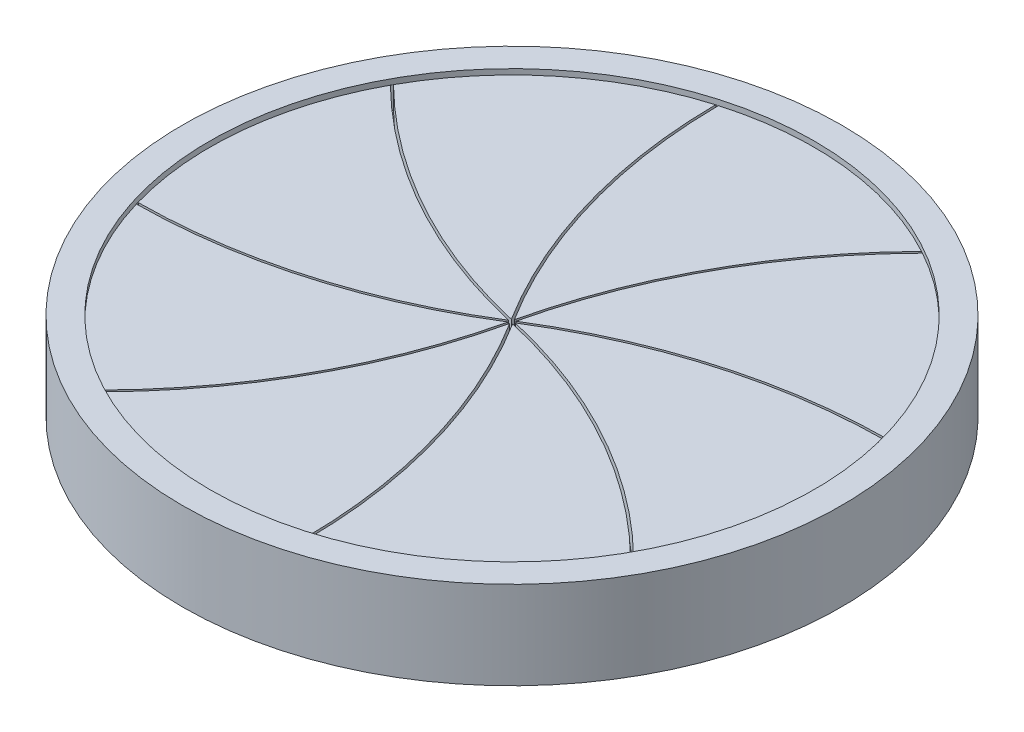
ISO-10303-21;
HEADER;
FILE_DESCRIPTION(('STEP AP214'),'2;1');
FILE_NAME('part.step','',(''),(''),'','','');
FILE_SCHEMA(('AUTOMOTIVE_DESIGN { 1 0 10303 214 1 1 1 1 }'));
ENDSEC;
DATA;
#1=APPLICATION_CONTEXT('core data for automotive mechanical design processes');
#2=APPLICATION_PROTOCOL_DEFINITION('international standard','automotive_design',2000,#1);
#3=PRODUCT_CONTEXT('',#1,'mechanical');
#4=PRODUCT('Part','Part','',(#3));
#5=PRODUCT_RELATED_PRODUCT_CATEGORY('part','',(#4));
#6=PRODUCT_DEFINITION_FORMATION('','',#4);
#7=PRODUCT_DEFINITION_CONTEXT('part definition',#1,'design');
#8=PRODUCT_DEFINITION('design','',#6,#7);
#9=PRODUCT_DEFINITION_SHAPE('','',#8);
#10=(LENGTH_UNIT() NAMED_UNIT(*) SI_UNIT(.MILLI.,.METRE.));
#11=(NAMED_UNIT(*) PLANE_ANGLE_UNIT() SI_UNIT($,.RADIAN.));
#12=(NAMED_UNIT(*) SI_UNIT($,.STERADIAN.) SOLID_ANGLE_UNIT());
#13=UNCERTAINTY_MEASURE_WITH_UNIT(LENGTH_MEASURE(1.E-05),#10,'distance_accuracy_value','');
#14=(GEOMETRIC_REPRESENTATION_CONTEXT(3) GLOBAL_UNCERTAINTY_ASSIGNED_CONTEXT((#13)) GLOBAL_UNIT_ASSIGNED_CONTEXT((#10,
#11,#12)) REPRESENTATION_CONTEXT('',''));
#15=CARTESIAN_POINT('',(0.,0.,0.));
#16=DIRECTION('',(0.,0.,1.));
#17=DIRECTION('',(1.,0.,0.));
#18=AXIS2_PLACEMENT_3D('',#15,#16,#17);
#19=CARTESIAN_POINT('',(0.,7.5,0.));
#20=DIRECTION('',(0.,1.,0.));
#21=DIRECTION('',(0.,0.,1.));
#22=AXIS2_PLACEMENT_3D('',#19,#20,#21);
#23=PLANE('',#22);
#24=CARTESIAN_POINT('',(-42.2702188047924,7.5,26.7063401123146));
#25=DIRECTION('',(0.,1.,0.));
#26=DIRECTION('',(1.,0.,0.));
#27=AXIS2_PLACEMENT_3D('',#24,#25,#26);
#28=CIRCLE('',#27,49.8999999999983);
#29=CARTESIAN_POINT('',(0.0437874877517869,7.5,0.257618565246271));
#30=VERTEX_POINT('',#29);
#31=CARTESIAN_POINT('',(7.62879246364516,7.5,26.3922152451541));
#32=VERTEX_POINT('',#31);
#33=EDGE_CURVE('E1080',#30,#32,#28,.F.);
#34=ORIENTED_EDGE('',*,*,#33,.F.);
#35=CARTESIAN_POINT('',(-48.7737925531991,7.5,-11.0053241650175));
#36=DIRECTION('',(0.,1.,0.));
#37=DIRECTION('',(1.,0.,0.));
#38=AXIS2_PLACEMENT_3D('',#35,#36,#37);
#39=CIRCLE('',#38,50.0999999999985);
#40=CARTESIAN_POINT('',(-13.1052008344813,7.5,24.1765115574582));
#41=VERTEX_POINT('',#40);
#42=EDGE_CURVE('E1095',#30,#41,#39,.F.);
#43=ORIENTED_EDGE('',*,*,#42,.T.);
#44=CARTESIAN_POINT('',(0.,7.5,0.));
#45=DIRECTION('',(0.,1.,0.));
#46=DIRECTION('',(0.,0.,1.));
#47=AXIS2_PLACEMENT_3D('',#44,#45,#46);
#48=CIRCLE('',#47,27.5);
#49=CARTESIAN_POINT('',(7.72879048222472,7.5,26.3915857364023));
#50=VERTEX_POINT('',#49);
#51=EDGE_CURVE('E1122',#41,#50,#48,.T.);
#52=ORIENTED_EDGE('',*,*,#51,.T.);
#53=DIRECTION('',(-0.999980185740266,0.,0.006295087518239));
#54=VECTOR('',#53,1.);
#55=CARTESIAN_POINT('',(7.82878850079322,7.5,26.3909562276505));
#56=LINE('',#55,#54);
#57=EDGE_CURVE('E12',#50,#32,#56,.T.);
#58=ORIENTED_EDGE('',*,*,#57,.T.);
#59=EDGE_LOOP('',(#34,#43,#52,#58));
#60=FACE_BOUND('',#59,.T.);
#61=ADVANCED_FACE('F707',(#60),#23,.T.);
#62=CARTESIAN_POINT('',(-11.0053241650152,7.5,48.7737925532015));
#63=DIRECTION('',(0.,1.,0.));
#64=DIRECTION('',(1.,0.,0.));
#65=AXIS2_PLACEMENT_3D('',#62,#63,#64);
#66=CIRCLE('',#65,49.8999999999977);
#67=CARTESIAN_POINT('',(0.213126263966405,7.5,0.151201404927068));
#68=VERTEX_POINT('',#67);
#69=CARTESIAN_POINT('',(24.0564852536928,7.5,13.2677434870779));
#70=VERTEX_POINT('',#69);
#71=EDGE_CURVE('E1057',#68,#70,#66,.F.);
#72=ORIENTED_EDGE('',*,*,#71,.F.);
#73=CARTESIAN_POINT('',(-42.2702188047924,7.5,26.7063401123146));
#74=DIRECTION('',(0.,1.,0.));
#75=DIRECTION('',(1.,0.,0.));
#76=AXIS2_PLACEMENT_3D('',#73,#74,#75);
#77=CIRCLE('',#76,50.0999999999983);
#78=CARTESIAN_POINT('',(7.82859888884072,7.5,26.3621516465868));
#79=VERTEX_POINT('',#78);
#80=EDGE_CURVE('E1074',#68,#79,#77,.F.);
#81=ORIENTED_EDGE('',*,*,#80,.T.);
#82=CARTESIAN_POINT('',(24.1267494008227,7.5,13.1965890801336));
#83=VERTEX_POINT('',#82);
#84=EDGE_CURVE('E1121',#79,#83,#48,.T.);
#85=ORIENTED_EDGE('',*,*,#84,.T.);
#86=DIRECTION('',(-0.702641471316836,0.,0.711544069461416));
#87=VECTOR('',#86,1.);
#88=CARTESIAN_POINT('',(24.1970135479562,7.5,13.1254346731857));
#89=LINE('',#88,#87);
#90=EDGE_CURVE('E716',#83,#70,#89,.T.);
#91=ORIENTED_EDGE('',*,*,#90,.T.);
#92=EDGE_LOOP('',(#72,#81,#85,#91));
#93=FACE_BOUND('',#92,.T.);
#94=ADVANCED_FACE('F1147',(#93),#23,.T.);
#95=CARTESIAN_POINT('',(26.706340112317,7.5,42.2702188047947));
#96=DIRECTION('',(0.,1.,0.));
#97=DIRECTION('',(1.,0.,0.));
#98=AXIS2_PLACEMENT_3D('',#95,#96,#97);
#99=CIRCLE('',#98,49.8999999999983);
#100=CARTESIAN_POINT('',(0.257618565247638,7.5,-0.0437874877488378));
#101=VERTEX_POINT('',#100);
#102=CARTESIAN_POINT('',(26.3922152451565,7.5,-7.62879246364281));
#103=VERTEX_POINT('',#102);
#104=EDGE_CURVE('E1033',#101,#103,#99,.F.);
#105=ORIENTED_EDGE('',*,*,#104,.F.);
#106=CARTESIAN_POINT('',(-11.0053241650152,7.5,48.7737925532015));
#107=DIRECTION('',(0.,1.,0.));
#108=DIRECTION('',(1.,0.,0.));
#109=AXIS2_PLACEMENT_3D('',#106,#107,#108);
#110=CIRCLE('',#109,50.0999999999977);
#111=CARTESIAN_POINT('',(24.1765115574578,7.5,13.1052008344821));
#112=VERTEX_POINT('',#111);
#113=EDGE_CURVE('E1051',#101,#112,#110,.F.);
#114=ORIENTED_EDGE('',*,*,#113,.T.);
#115=CARTESIAN_POINT('',(26.3915857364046,7.5,-7.72879048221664));
#116=VERTEX_POINT('',#115);
#117=EDGE_CURVE('E1221',#112,#116,#48,.T.);
#118=ORIENTED_EDGE('',*,*,#117,.T.);
#119=DIRECTION('',(0.006295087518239,0.,0.999980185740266));
#120=VECTOR('',#119,1.);
#121=CARTESIAN_POINT('',(26.3909562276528,7.5,-7.82878850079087));
#122=LINE('',#121,#120);
#123=EDGE_CURVE('E1040',#116,#103,#122,.T.);
#124=ORIENTED_EDGE('',*,*,#123,.T.);
#125=EDGE_LOOP('',(#105,#114,#118,#124));
#126=FACE_BOUND('',#125,.T.);
#127=ADVANCED_FACE('F1154',(#126),#23,.T.);
#128=CARTESIAN_POINT('',(48.7737925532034,7.5,11.0053241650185));
#129=DIRECTION('',(0.,1.,0.));
#130=DIRECTION('',(1.,0.,0.));
#131=AXIS2_PLACEMENT_3D('',#128,#129,#130);
#132=CIRCLE('',#131,49.8999999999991);
#133=CARTESIAN_POINT('',(0.151201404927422,7.5,-0.213126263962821));
#134=VERTEX_POINT('',#133);
#135=CARTESIAN_POINT('',(13.2677434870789,7.5,-24.0564852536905));
#136=VERTEX_POINT('',#135);
#137=EDGE_CURVE('E1009',#134,#136,#132,.F.);
#138=ORIENTED_EDGE('',*,*,#137,.F.);
#139=CARTESIAN_POINT('',(26.706340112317,7.5,42.2702188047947));
#140=DIRECTION('',(0.,1.,0.));
#141=DIRECTION('',(1.,0.,0.));
#142=AXIS2_PLACEMENT_3D('',#139,#140,#141);
#143=CIRCLE('',#142,50.0999999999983);
#144=CARTESIAN_POINT('',(26.3621516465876,7.5,-7.82859888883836));
#145=VERTEX_POINT('',#144);
#146=EDGE_CURVE('E1027',#134,#145,#143,.F.);
#147=ORIENTED_EDGE('',*,*,#146,.T.);
#148=CARTESIAN_POINT('',(13.1965890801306,7.5,-24.1267494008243));
#149=VERTEX_POINT('',#148);
#150=EDGE_CURVE('E1223',#145,#149,#48,.T.);
#151=ORIENTED_EDGE('',*,*,#150,.T.);
#152=DIRECTION('',(0.711544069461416,0.,0.702641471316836));
#153=VECTOR('',#152,1.);
#154=CARTESIAN_POINT('',(13.1254346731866,7.5,-24.1970135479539));
#155=LINE('',#154,#153);
#156=EDGE_CURVE('E1016',#149,#136,#155,.T.);
#157=ORIENTED_EDGE('',*,*,#156,.T.);
#158=EDGE_LOOP('',(#138,#147,#151,#157));
#159=FACE_BOUND('',#158,.T.);
#160=ADVANCED_FACE('F1603',(#159),#23,.T.);
#161=CARTESIAN_POINT('',(42.2702188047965,7.5,-26.7063401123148));
#162=DIRECTION('',(0.,1.,0.));
#163=DIRECTION('',(1.,0.,0.));
#164=AXIS2_PLACEMENT_3D('',#161,#162,#163);
#165=CIRCLE('',#164,49.8999999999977);
#166=CARTESIAN_POINT('',(-0.0437874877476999,7.5,-0.25761856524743));
#167=VERTEX_POINT('',#166);
#168=CARTESIAN_POINT('',(-7.62879246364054,7.5,-26.3922152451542));
#169=VERTEX_POINT('',#168);
#170=EDGE_CURVE('E985',#167,#169,#165,.F.);
#171=ORIENTED_EDGE('',*,*,#170,.F.);
#172=CARTESIAN_POINT('',(48.7737925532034,7.5,11.0053241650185));
#173=DIRECTION('',(0.,1.,0.));
#174=DIRECTION('',(1.,0.,0.));
#175=AXIS2_PLACEMENT_3D('',#172,#173,#174);
#176=CIRCLE('',#175,50.0999999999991);
#177=CARTESIAN_POINT('',(13.1052008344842,7.5,-24.1765115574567));
#178=VERTEX_POINT('',#177);
#179=EDGE_CURVE('E1003',#167,#178,#176,.F.);
#180=ORIENTED_EDGE('',*,*,#179,.T.);
#181=CARTESIAN_POINT('',(-7.72879048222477,7.5,-26.3915857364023));
#182=VERTEX_POINT('',#181);
#183=EDGE_CURVE('E1228',#178,#182,#48,.T.);
#184=ORIENTED_EDGE('',*,*,#183,.T.);
#185=DIRECTION('',(0.999980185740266,0.,-0.00629508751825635));
#186=VECTOR('',#185,1.);
#187=CARTESIAN_POINT('',(-7.82878850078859,7.5,-26.3909562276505));
#188=LINE('',#187,#186);
#189=EDGE_CURVE('E992',#182,#169,#188,.T.);
#190=ORIENTED_EDGE('',*,*,#189,.T.);
#191=EDGE_LOOP('',(#171,#180,#184,#190));
#192=FACE_BOUND('',#191,.T.);
#193=ADVANCED_FACE('F1610',(#192),#23,.T.);
#194=CARTESIAN_POINT('',(11.0053241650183,7.5,-48.7737925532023));
#195=DIRECTION('',(0.,1.,0.));
#196=DIRECTION('',(1.,0.,0.));
#197=AXIS2_PLACEMENT_3D('',#194,#195,#196);
#198=CIRCLE('',#197,49.8999999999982);
#199=CARTESIAN_POINT('',(-0.21312626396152,7.5,-0.151201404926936));
#200=VERTEX_POINT('',#199);
#201=CARTESIAN_POINT('',(-24.0564852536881,7.5,-13.2677434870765));
#202=VERTEX_POINT('',#201);
#203=EDGE_CURVE('E960',#200,#202,#198,.F.);
#204=ORIENTED_EDGE('',*,*,#203,.F.);
#205=CARTESIAN_POINT('',(42.2702188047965,7.5,-26.7063401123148));
#206=DIRECTION('',(0.,1.,0.));
#207=DIRECTION('',(1.,0.,0.));
#208=AXIS2_PLACEMENT_3D('',#205,#206,#207);
#209=CIRCLE('',#208,50.0999999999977);
#210=CARTESIAN_POINT('',(-7.82859888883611,7.5,-26.3621516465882));
#211=VERTEX_POINT('',#210);
#212=EDGE_CURVE('E979',#200,#211,#209,.F.);
#213=ORIENTED_EDGE('',*,*,#212,.T.);
#214=CARTESIAN_POINT('',(-24.1267494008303,7.5,-13.1965890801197));
#215=VERTEX_POINT('',#214);
#216=EDGE_CURVE('E1234',#211,#215,#48,.T.);
#217=ORIENTED_EDGE('',*,*,#216,.T.);
#218=DIRECTION('',(0.702641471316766,0.,-0.711544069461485));
#219=VECTOR('',#218,1.);
#220=CARTESIAN_POINT('',(-24.1970135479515,7.5,-13.1254346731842));
#221=LINE('',#220,#219);
#222=EDGE_CURVE('E967',#215,#202,#221,.T.);
#223=ORIENTED_EDGE('',*,*,#222,.T.);
#224=EDGE_LOOP('',(#204,#213,#217,#223));
#225=FACE_BOUND('',#224,.T.);
#226=ADVANCED_FACE('F1166',(#225),#23,.T.);
#227=CARTESIAN_POINT('',(-26.7063401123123,7.5,-42.2702188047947));
#228=DIRECTION('',(0.,1.,0.));
#229=DIRECTION('',(1.,0.,0.));
#230=AXIS2_PLACEMENT_3D('',#227,#228,#229);
#231=CIRCLE('',#230,49.8999999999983);
#232=CARTESIAN_POINT('',(-0.257618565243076,7.5,0.0437874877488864));
#233=VERTEX_POINT('',#232);
#234=CARTESIAN_POINT('',(-26.3922152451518,7.5,7.6287924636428));
#235=VERTEX_POINT('',#234);
#236=EDGE_CURVE('E945',#233,#235,#231,.F.);
#237=ORIENTED_EDGE('',*,*,#236,.F.);
#238=CARTESIAN_POINT('',(11.0053241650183,7.5,-48.7737925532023));
#239=DIRECTION('',(0.,1.,0.));
#240=DIRECTION('',(1.,0.,0.));
#241=AXIS2_PLACEMENT_3D('',#238,#239,#240);
#242=CIRCLE('',#241,50.0999999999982);
#243=CARTESIAN_POINT('',(-24.1765115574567,7.5,-13.1052008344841));
#244=VERTEX_POINT('',#243);
#245=EDGE_CURVE('E955',#233,#244,#242,.F.);
#246=ORIENTED_EDGE('',*,*,#245,.T.);
#247=CARTESIAN_POINT('',(-26.3915857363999,7.5,7.7287904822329));
#248=VERTEX_POINT('',#247);
#249=EDGE_CURVE('E1240',#244,#248,#48,.T.);
#250=ORIENTED_EDGE('',*,*,#249,.T.);
#251=DIRECTION('',(-0.006295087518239,0.,-0.999980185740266));
#252=VECTOR('',#251,1.);
#253=CARTESIAN_POINT('',(-26.3909562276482,7.5,7.82878850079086));
#254=LINE('',#253,#252);
#255=EDGE_CURVE('E1128',#248,#235,#254,.T.);
#256=ORIENTED_EDGE('',*,*,#255,.T.);
#257=EDGE_LOOP('',(#237,#246,#250,#256));
#258=FACE_BOUND('',#257,.T.);
#259=ADVANCED_FACE('F1159',(#258),#23,.T.);
#260=CARTESIAN_POINT('',(-48.7737925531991,7.5,-11.0053241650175));
#261=DIRECTION('',(0.,1.,0.));
#262=DIRECTION('',(1.,0.,0.));
#263=AXIS2_PLACEMENT_3D('',#260,#261,#262);
#264=CIRCLE('',#263,49.8999999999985);
#265=CARTESIAN_POINT('',(-0.151201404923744,7.5,0.213126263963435));
#266=VERTEX_POINT('',#265);
#267=CARTESIAN_POINT('',(-13.2677434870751,7.5,24.0564852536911));
#268=VERTEX_POINT('',#267);
#269=EDGE_CURVE('E1099',#266,#268,#264,.F.);
#270=ORIENTED_EDGE('',*,*,#269,.F.);
#271=CARTESIAN_POINT('',(-26.7063401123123,7.5,-42.2702188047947));
#272=DIRECTION('',(0.,1.,0.));
#273=DIRECTION('',(1.,0.,0.));
#274=AXIS2_PLACEMENT_3D('',#271,#272,#273);
#275=CIRCLE('',#274,50.0999999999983);
#276=CARTESIAN_POINT('',(-26.3621516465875,7.5,7.82859888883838));
#277=VERTEX_POINT('',#276);
#278=EDGE_CURVE('E930',#266,#277,#275,.F.);
#279=ORIENTED_EDGE('',*,*,#278,.T.);
#280=CARTESIAN_POINT('',(-13.1965890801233,7.5,24.1267494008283));
#281=VERTEX_POINT('',#280);
#282=EDGE_CURVE('E1246',#277,#281,#48,.T.);
#283=ORIENTED_EDGE('',*,*,#282,.T.);
#284=DIRECTION('',(-0.711544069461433,0.,-0.702641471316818));
#285=VECTOR('',#284,1.);
#286=CARTESIAN_POINT('',(-13.1254346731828,7.5,24.1970135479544));
#287=LINE('',#286,#285);
#288=EDGE_CURVE('E730',#281,#268,#287,.T.);
#289=ORIENTED_EDGE('',*,*,#288,.T.);
#290=EDGE_LOOP('',(#270,#279,#283,#289));
#291=FACE_BOUND('',#290,.T.);
#292=ADVANCED_FACE('F1150',(#291),#23,.T.);
#293=CARTESIAN_POINT('',(0.,8.,0.));
#294=DIRECTION('',(0.,-1.,0.));
#295=DIRECTION('',(0.,0.,-1.));
#296=AXIS2_PLACEMENT_3D('',#293,#294,#295);
#297=CYLINDRICAL_SURFACE('',#296,30.);
#298=CARTESIAN_POINT('',(0.,8.,0.));
#299=DIRECTION('',(0.,1.,0.));
#300=DIRECTION('',(0.,0.,1.));
#301=AXIS2_PLACEMENT_3D('',#298,#299,#300);
#302=CIRCLE('',#301,30.);
#303=CARTESIAN_POINT('',(0.,8.,30.));
#304=VERTEX_POINT('',#303);
#305=EDGE_CURVE('E1124',#304,#304,#302,.T.);
#306=ORIENTED_EDGE('',*,*,#305,.F.);
#307=EDGE_LOOP('',(#306));
#308=FACE_BOUND('',#307,.T.);
#309=CARTESIAN_POINT('',(0.,0.,0.));
#310=DIRECTION('',(0.,1.,0.));
#311=DIRECTION('',(0.,0.,1.));
#312=AXIS2_PLACEMENT_3D('',#309,#310,#311);
#313=CIRCLE('',#312,30.);
#314=CARTESIAN_POINT('',(0.,0.,30.));
#315=VERTEX_POINT('',#314);
#316=EDGE_CURVE('E711',#315,#315,#313,.T.);
#317=ORIENTED_EDGE('',*,*,#316,.T.);
#318=EDGE_LOOP('',(#317));
#319=FACE_BOUND('',#318,.T.);
#320=ADVANCED_FACE('F709',(#308,#319),#297,.T.);
#321=CARTESIAN_POINT('',(0.,8.,0.));
#322=DIRECTION('',(0.,1.,0.));
#323=DIRECTION('',(0.,0.,1.));
#324=AXIS2_PLACEMENT_3D('',#321,#322,#323);
#325=PLANE('',#324);
#326=CARTESIAN_POINT('',(0.,8.,0.));
#327=DIRECTION('',(0.,1.,0.));
#328=DIRECTION('',(0.,0.,1.));
#329=AXIS2_PLACEMENT_3D('',#326,#327,#328);
#330=CIRCLE('',#329,27.5);
#331=CARTESIAN_POINT('',(0.,8.,27.5));
#332=VERTEX_POINT('',#331);
#333=EDGE_CURVE('E1117',#332,#332,#330,.T.);
#334=ORIENTED_EDGE('',*,*,#333,.F.);
#335=EDGE_LOOP('',(#334));
#336=FACE_BOUND('',#335,.T.);
#337=ORIENTED_EDGE('',*,*,#305,.T.);
#338=EDGE_LOOP('',(#337));
#339=FACE_BOUND('',#338,.T.);
#340=ADVANCED_FACE('F1136',(#336,#339),#325,.T.);
#341=CARTESIAN_POINT('',(0.,0.,0.));
#342=DIRECTION('',(0.,1.,0.));
#343=DIRECTION('',(0.,0.,1.));
#344=AXIS2_PLACEMENT_3D('',#341,#342,#343);
#345=PLANE('',#344);
#346=ORIENTED_EDGE('',*,*,#316,.F.);
#347=EDGE_LOOP('',(#346));
#348=FACE_BOUND('',#347,.T.);
#349=ADVANCED_FACE('F1133',(#348),#345,.F.);
#350=CARTESIAN_POINT('',(0.,7.5,0.));
#351=DIRECTION('',(0.,1.,0.));
#352=DIRECTION('',(0.,0.,1.));
#353=AXIS2_PLACEMENT_3D('',#350,#351,#352);
#354=CYLINDRICAL_SURFACE('',#353,27.5);
#355=EDGE_CURVE('E1119',#50,#79,#48,.T.);
#356=ORIENTED_EDGE('',*,*,#355,.F.);
#357=ORIENTED_EDGE('',*,*,#51,.F.);
#358=EDGE_CURVE('E1247',#281,#41,#48,.T.);
#359=ORIENTED_EDGE('',*,*,#358,.F.);
#360=ORIENTED_EDGE('',*,*,#282,.F.);
#361=EDGE_CURVE('E1244',#248,#277,#48,.T.);
#362=ORIENTED_EDGE('',*,*,#361,.F.);
#363=ORIENTED_EDGE('',*,*,#249,.F.);
#364=EDGE_CURVE('E1238',#215,#244,#48,.T.);
#365=ORIENTED_EDGE('',*,*,#364,.F.);
#366=ORIENTED_EDGE('',*,*,#216,.F.);
#367=EDGE_CURVE('E1232',#182,#211,#48,.T.);
#368=ORIENTED_EDGE('',*,*,#367,.F.);
#369=ORIENTED_EDGE('',*,*,#183,.F.);
#370=EDGE_CURVE('E1226',#149,#178,#48,.T.);
#371=ORIENTED_EDGE('',*,*,#370,.F.);
#372=ORIENTED_EDGE('',*,*,#150,.F.);
#373=EDGE_CURVE('E1222',#116,#145,#48,.T.);
#374=ORIENTED_EDGE('',*,*,#373,.F.);
#375=ORIENTED_EDGE('',*,*,#117,.F.);
#376=EDGE_CURVE('E1215',#83,#112,#48,.T.);
#377=ORIENTED_EDGE('',*,*,#376,.F.);
#378=ORIENTED_EDGE('',*,*,#84,.F.);
#379=EDGE_LOOP('',(#356,#357,#359,#360,#362,#363,#365,#366,#368,#369,#371,#372,#374,#375,#377,#378));
#380=FACE_BOUND('',#379,.T.);
#381=ORIENTED_EDGE('',*,*,#333,.T.);
#382=EDGE_LOOP('',(#381));
#383=FACE_BOUND('',#382,.T.);
#384=ADVANCED_FACE('F1135',(#380,#383),#354,.F.);
#385=CARTESIAN_POINT('',(-26.7063401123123,7.5,-42.2702188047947));
#386=DIRECTION('',(0.,1.,0.));
#387=DIRECTION('',(1.,0.,0.));
#388=AXIS2_PLACEMENT_3D('',#385,#386,#387);
#389=PLANE('',#388);
#390=ORIENTED_EDGE('',*,*,#355,.T.);
#391=CARTESIAN_POINT('',(7.82878850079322,7.5,26.3909562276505));
#392=VERTEX_POINT('',#391);
#393=EDGE_CURVE('E1084',#79,#392,#77,.F.);
#394=ORIENTED_EDGE('',*,*,#393,.T.);
#395=EDGE_CURVE('E718',#392,#50,#56,.T.);
#396=ORIENTED_EDGE('',*,*,#395,.T.);
#397=EDGE_LOOP('',(#390,#394,#396));
#398=FACE_BOUND('',#397,.T.);
#399=ADVANCED_FACE('F1141',(#398),#389,.F.);
#400=ORIENTED_EDGE('',*,*,#376,.T.);
#401=CARTESIAN_POINT('',(24.1970135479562,7.5,13.1254346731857));
#402=VERTEX_POINT('',#401);
#403=EDGE_CURVE('E1063',#112,#402,#110,.F.);
#404=ORIENTED_EDGE('',*,*,#403,.T.);
#405=EDGE_CURVE('E1059',#402,#83,#89,.T.);
#406=ORIENTED_EDGE('',*,*,#405,.T.);
#407=EDGE_LOOP('',(#400,#404,#406));
#408=FACE_BOUND('',#407,.T.);
#409=ADVANCED_FACE('F1214',(#408),#389,.F.);
#410=ORIENTED_EDGE('',*,*,#373,.T.);
#411=CARTESIAN_POINT('',(26.3909562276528,7.5,-7.82878850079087));
#412=VERTEX_POINT('',#411);
#413=EDGE_CURVE('E1039',#145,#412,#143,.F.);
#414=ORIENTED_EDGE('',*,*,#413,.T.);
#415=EDGE_CURVE('E1035',#412,#116,#122,.T.);
#416=ORIENTED_EDGE('',*,*,#415,.T.);
#417=EDGE_LOOP('',(#410,#414,#416));
#418=FACE_BOUND('',#417,.T.);
#419=ADVANCED_FACE('F1567',(#418),#389,.F.);
#420=ORIENTED_EDGE('',*,*,#370,.T.);
#421=CARTESIAN_POINT('',(13.1254346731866,7.5,-24.1970135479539));
#422=VERTEX_POINT('',#421);
#423=EDGE_CURVE('E1015',#178,#422,#176,.F.);
#424=ORIENTED_EDGE('',*,*,#423,.T.);
#425=EDGE_CURVE('E1011',#422,#149,#155,.T.);
#426=ORIENTED_EDGE('',*,*,#425,.T.);
#427=EDGE_LOOP('',(#420,#424,#426));
#428=FACE_BOUND('',#427,.T.);
#429=ADVANCED_FACE('F1394',(#428),#389,.F.);
#430=ORIENTED_EDGE('',*,*,#367,.T.);
#431=CARTESIAN_POINT('',(-7.82878850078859,7.5,-26.3909562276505));
#432=VERTEX_POINT('',#431);
#433=EDGE_CURVE('E991',#211,#432,#209,.F.);
#434=ORIENTED_EDGE('',*,*,#433,.T.);
#435=EDGE_CURVE('E987',#432,#182,#188,.T.);
#436=ORIENTED_EDGE('',*,*,#435,.T.);
#437=EDGE_LOOP('',(#430,#434,#436));
#438=FACE_BOUND('',#437,.T.);
#439=ADVANCED_FACE('F1388',(#438),#389,.F.);
#440=ORIENTED_EDGE('',*,*,#364,.T.);
#441=CARTESIAN_POINT('',(-24.1970135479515,7.5,-13.1254346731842));
#442=VERTEX_POINT('',#441);
#443=EDGE_CURVE('E966',#244,#442,#242,.F.);
#444=ORIENTED_EDGE('',*,*,#443,.T.);
#445=EDGE_CURVE('E962',#442,#215,#221,.T.);
#446=ORIENTED_EDGE('',*,*,#445,.T.);
#447=EDGE_LOOP('',(#440,#444,#446));
#448=FACE_BOUND('',#447,.T.);
#449=ADVANCED_FACE('F1385',(#448),#389,.F.);
#450=ORIENTED_EDGE('',*,*,#361,.T.);
#451=CARTESIAN_POINT('',(-26.3909562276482,7.5,7.82878850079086));
#452=VERTEX_POINT('',#451);
#453=EDGE_CURVE('E1179',#277,#452,#275,.F.);
#454=ORIENTED_EDGE('',*,*,#453,.T.);
#455=EDGE_CURVE('E1180',#452,#248,#254,.T.);
#456=ORIENTED_EDGE('',*,*,#455,.T.);
#457=EDGE_LOOP('',(#450,#454,#456));
#458=FACE_BOUND('',#457,.T.);
#459=ADVANCED_FACE('F1387',(#458),#389,.F.);
#460=ORIENTED_EDGE('',*,*,#358,.T.);
#461=CARTESIAN_POINT('',(-13.1254346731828,7.5,24.1970135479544));
#462=VERTEX_POINT('',#461);
#463=EDGE_CURVE('E1103',#41,#462,#39,.F.);
#464=ORIENTED_EDGE('',*,*,#463,.T.);
#465=EDGE_CURVE('E1101',#462,#281,#287,.T.);
#466=ORIENTED_EDGE('',*,*,#465,.T.);
#467=EDGE_LOOP('',(#460,#464,#466));
#468=FACE_BOUND('',#467,.T.);
#469=ADVANCED_FACE('F1273',(#468),#389,.F.);
#470=CARTESIAN_POINT('',(-26.7063401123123,5.5,-42.2702188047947));
#471=DIRECTION('',(0.,1.,0.));
#472=DIRECTION('',(1.,0.,0.));
#473=AXIS2_PLACEMENT_3D('',#470,#471,#472);
#474=PLANE('',#473);
#475=CARTESIAN_POINT('',(-42.2702188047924,5.5,26.7063401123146));
#476=DIRECTION('',(0.,1.,0.));
#477=DIRECTION('',(1.,0.,0.));
#478=AXIS2_PLACEMENT_3D('',#475,#476,#477);
#479=CIRCLE('',#478,49.8999999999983);
#480=CARTESIAN_POINT('',(0.0437874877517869,5.5,0.257618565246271));
#481=VERTEX_POINT('',#480);
#482=CARTESIAN_POINT('',(7.62879246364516,5.5,26.3922152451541));
#483=VERTEX_POINT('',#482);
#484=EDGE_CURVE('E1071',#481,#483,#479,.F.);
#485=ORIENTED_EDGE('',*,*,#484,.T.);
#486=DIRECTION('',(-0.999980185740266,0.,0.006295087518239));
#487=VECTOR('',#486,1.);
#488=CARTESIAN_POINT('',(7.82878850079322,5.5,26.3909562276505));
#489=LINE('',#488,#487);
#490=CARTESIAN_POINT('',(7.82878850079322,5.5,26.3909562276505));
#491=VERTEX_POINT('',#490);
#492=EDGE_CURVE('E1073',#491,#483,#489,.T.);
#493=ORIENTED_EDGE('',*,*,#492,.F.);
#494=CARTESIAN_POINT('',(-42.2702188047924,5.5,26.7063401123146));
#495=DIRECTION('',(0.,1.,0.));
#496=DIRECTION('',(1.,0.,0.));
#497=AXIS2_PLACEMENT_3D('',#494,#495,#496);
#498=CIRCLE('',#497,50.0999999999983);
#499=CARTESIAN_POINT('',(0.213126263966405,5.5,0.151201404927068));
#500=VERTEX_POINT('',#499);
#501=EDGE_CURVE('E1077',#500,#491,#498,.F.);
#502=ORIENTED_EDGE('',*,*,#501,.F.);
#503=CARTESIAN_POINT('',(-11.0053241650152,5.5,48.7737925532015));
#504=DIRECTION('',(0.,1.,0.));
#505=DIRECTION('',(1.,0.,0.));
#506=AXIS2_PLACEMENT_3D('',#503,#504,#505);
#507=CIRCLE('',#506,49.8999999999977);
#508=CARTESIAN_POINT('',(24.0564852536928,5.5,13.2677434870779));
#509=VERTEX_POINT('',#508);
#510=EDGE_CURVE('E1048',#500,#509,#507,.F.);
#511=ORIENTED_EDGE('',*,*,#510,.T.);
#512=DIRECTION('',(-0.702641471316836,0.,0.711544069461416));
#513=VECTOR('',#512,1.);
#514=CARTESIAN_POINT('',(24.1970135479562,5.5,13.1254346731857));
#515=LINE('',#514,#513);
#516=CARTESIAN_POINT('',(24.1970135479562,5.5,13.1254346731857));
#517=VERTEX_POINT('',#516);
#518=EDGE_CURVE('E1050',#517,#509,#515,.T.);
#519=ORIENTED_EDGE('',*,*,#518,.F.);
#520=CARTESIAN_POINT('',(-11.0053241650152,5.5,48.7737925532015));
#521=DIRECTION('',(0.,1.,0.));
#522=DIRECTION('',(1.,0.,0.));
#523=AXIS2_PLACEMENT_3D('',#520,#521,#522);
#524=CIRCLE('',#523,50.0999999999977);
#525=CARTESIAN_POINT('',(0.257618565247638,5.5,-0.0437874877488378));
#526=VERTEX_POINT('',#525);
#527=EDGE_CURVE('E1054',#526,#517,#524,.F.);
#528=ORIENTED_EDGE('',*,*,#527,.F.);
#529=CARTESIAN_POINT('',(26.706340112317,5.5,42.2702188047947));
#530=DIRECTION('',(0.,1.,0.));
#531=DIRECTION('',(1.,0.,0.));
#532=AXIS2_PLACEMENT_3D('',#529,#530,#531);
#533=CIRCLE('',#532,49.8999999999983);
#534=CARTESIAN_POINT('',(26.3922152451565,5.5,-7.62879246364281));
#535=VERTEX_POINT('',#534);
#536=EDGE_CURVE('E1024',#526,#535,#533,.F.);
#537=ORIENTED_EDGE('',*,*,#536,.T.);
#538=DIRECTION('',(0.006295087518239,0.,0.999980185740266));
#539=VECTOR('',#538,1.);
#540=CARTESIAN_POINT('',(26.3909562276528,5.5,-7.82878850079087));
#541=LINE('',#540,#539);
#542=CARTESIAN_POINT('',(26.3909562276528,5.5,-7.82878850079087));
#543=VERTEX_POINT('',#542);
#544=EDGE_CURVE('E1026',#543,#535,#541,.T.);
#545=ORIENTED_EDGE('',*,*,#544,.F.);
#546=CARTESIAN_POINT('',(26.706340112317,5.5,42.2702188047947));
#547=DIRECTION('',(0.,1.,0.));
#548=DIRECTION('',(1.,0.,0.));
#549=AXIS2_PLACEMENT_3D('',#546,#547,#548);
#550=CIRCLE('',#549,50.0999999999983);
#551=CARTESIAN_POINT('',(0.151201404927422,5.5,-0.213126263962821));
#552=VERTEX_POINT('',#551);
#553=EDGE_CURVE('E1030',#552,#543,#550,.F.);
#554=ORIENTED_EDGE('',*,*,#553,.F.);
#555=CARTESIAN_POINT('',(48.7737925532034,5.5,11.0053241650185));
#556=DIRECTION('',(0.,1.,0.));
#557=DIRECTION('',(1.,0.,0.));
#558=AXIS2_PLACEMENT_3D('',#555,#556,#557);
#559=CIRCLE('',#558,49.8999999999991);
#560=CARTESIAN_POINT('',(13.2677434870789,5.5,-24.0564852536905));
#561=VERTEX_POINT('',#560);
#562=EDGE_CURVE('E1000',#552,#561,#559,.F.);
#563=ORIENTED_EDGE('',*,*,#562,.T.);
#564=DIRECTION('',(0.711544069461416,0.,0.702641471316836));
#565=VECTOR('',#564,1.);
#566=CARTESIAN_POINT('',(13.1254346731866,5.5,-24.1970135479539));
#567=LINE('',#566,#565);
#568=CARTESIAN_POINT('',(13.1254346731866,5.5,-24.1970135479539));
#569=VERTEX_POINT('',#568);
#570=EDGE_CURVE('E1002',#569,#561,#567,.T.);
#571=ORIENTED_EDGE('',*,*,#570,.F.);
#572=CARTESIAN_POINT('',(48.7737925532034,5.5,11.0053241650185));
#573=DIRECTION('',(0.,1.,0.));
#574=DIRECTION('',(1.,0.,0.));
#575=AXIS2_PLACEMENT_3D('',#572,#573,#574);
#576=CIRCLE('',#575,50.0999999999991);
#577=CARTESIAN_POINT('',(-0.0437874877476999,5.5,-0.25761856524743));
#578=VERTEX_POINT('',#577);
#579=EDGE_CURVE('E1006',#578,#569,#576,.F.);
#580=ORIENTED_EDGE('',*,*,#579,.F.);
#581=CARTESIAN_POINT('',(42.2702188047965,5.5,-26.7063401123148));
#582=DIRECTION('',(0.,1.,0.));
#583=DIRECTION('',(1.,0.,0.));
#584=AXIS2_PLACEMENT_3D('',#581,#582,#583);
#585=CIRCLE('',#584,49.8999999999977);
#586=CARTESIAN_POINT('',(-7.62879246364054,5.5,-26.3922152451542));
#587=VERTEX_POINT('',#586);
#588=EDGE_CURVE('E976',#578,#587,#585,.F.);
#589=ORIENTED_EDGE('',*,*,#588,.T.);
#590=DIRECTION('',(0.999980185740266,0.,-0.00629508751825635));
#591=VECTOR('',#590,1.);
#592=CARTESIAN_POINT('',(-7.82878850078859,5.5,-26.3909562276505));
#593=LINE('',#592,#591);
#594=CARTESIAN_POINT('',(-7.82878850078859,5.5,-26.3909562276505));
#595=VERTEX_POINT('',#594);
#596=EDGE_CURVE('E978',#595,#587,#593,.T.);
#597=ORIENTED_EDGE('',*,*,#596,.F.);
#598=CARTESIAN_POINT('',(42.2702188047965,5.5,-26.7063401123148));
#599=DIRECTION('',(0.,1.,0.));
#600=DIRECTION('',(1.,0.,0.));
#601=AXIS2_PLACEMENT_3D('',#598,#599,#600);
#602=CIRCLE('',#601,50.0999999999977);
#603=CARTESIAN_POINT('',(-0.21312626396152,5.5,-0.151201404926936));
#604=VERTEX_POINT('',#603);
#605=EDGE_CURVE('E982',#604,#595,#602,.F.);
#606=ORIENTED_EDGE('',*,*,#605,.F.);
#607=CARTESIAN_POINT('',(11.0053241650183,5.5,-48.7737925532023));
#608=DIRECTION('',(0.,1.,0.));
#609=DIRECTION('',(1.,0.,0.));
#610=AXIS2_PLACEMENT_3D('',#607,#608,#609);
#611=CIRCLE('',#610,49.8999999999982);
#612=CARTESIAN_POINT('',(-24.0564852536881,5.5,-13.2677434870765));
#613=VERTEX_POINT('',#612);
#614=EDGE_CURVE('E952',#604,#613,#611,.F.);
#615=ORIENTED_EDGE('',*,*,#614,.T.);
#616=DIRECTION('',(0.702641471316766,0.,-0.711544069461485));
#617=VECTOR('',#616,1.);
#618=CARTESIAN_POINT('',(-24.1970135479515,5.5,-13.1254346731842));
#619=LINE('',#618,#617);
#620=CARTESIAN_POINT('',(-24.1970135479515,5.5,-13.1254346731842));
#621=VERTEX_POINT('',#620);
#622=EDGE_CURVE('E954',#621,#613,#619,.T.);
#623=ORIENTED_EDGE('',*,*,#622,.F.);
#624=CARTESIAN_POINT('',(11.0053241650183,5.5,-48.7737925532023));
#625=DIRECTION('',(0.,1.,0.));
#626=DIRECTION('',(1.,0.,0.));
#627=AXIS2_PLACEMENT_3D('',#624,#625,#626);
#628=CIRCLE('',#627,50.0999999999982);
#629=CARTESIAN_POINT('',(-0.257618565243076,5.5,0.0437874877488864));
#630=VERTEX_POINT('',#629);
#631=EDGE_CURVE('E927',#630,#621,#628,.F.);
#632=ORIENTED_EDGE('',*,*,#631,.F.);
#633=CARTESIAN_POINT('',(-26.7063401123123,5.5,-42.2702188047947));
#634=DIRECTION('',(0.,1.,0.));
#635=DIRECTION('',(1.,0.,0.));
#636=AXIS2_PLACEMENT_3D('',#633,#634,#635);
#637=CIRCLE('',#636,49.8999999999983);
#638=CARTESIAN_POINT('',(-26.3922152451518,5.5,7.6287924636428));
#639=VERTEX_POINT('',#638);
#640=EDGE_CURVE('E921',#630,#639,#637,.F.);
#641=ORIENTED_EDGE('',*,*,#640,.T.);
#642=DIRECTION('',(-0.006295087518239,0.,-0.999980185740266));
#643=VECTOR('',#642,1.);
#644=CARTESIAN_POINT('',(-26.3909562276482,5.5,7.82878850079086));
#645=LINE('',#644,#643);
#646=CARTESIAN_POINT('',(-26.3909562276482,5.5,7.82878850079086));
#647=VERTEX_POINT('',#646);
#648=EDGE_CURVE('E925',#647,#639,#645,.T.);
#649=ORIENTED_EDGE('',*,*,#648,.F.);
#650=CARTESIAN_POINT('',(-26.7063401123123,5.5,-42.2702188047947));
#651=DIRECTION('',(0.,1.,0.));
#652=DIRECTION('',(1.,0.,0.));
#653=AXIS2_PLACEMENT_3D('',#650,#651,#652);
#654=CIRCLE('',#653,50.0999999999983);
#655=CARTESIAN_POINT('',(-0.151201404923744,5.5,0.213126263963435));
#656=VERTEX_POINT('',#655);
#657=EDGE_CURVE('E941',#656,#647,#654,.F.);
#658=ORIENTED_EDGE('',*,*,#657,.F.);
#659=CARTESIAN_POINT('',(-48.7737925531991,5.5,-11.0053241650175));
#660=DIRECTION('',(0.,1.,0.));
#661=DIRECTION('',(1.,0.,0.));
#662=AXIS2_PLACEMENT_3D('',#659,#660,#661);
#663=CIRCLE('',#662,49.8999999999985);
#664=CARTESIAN_POINT('',(-13.2677434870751,5.5,24.0564852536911));
#665=VERTEX_POINT('',#664);
#666=EDGE_CURVE('E1092',#656,#665,#663,.F.);
#667=ORIENTED_EDGE('',*,*,#666,.T.);
#668=DIRECTION('',(-0.711544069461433,0.,-0.702641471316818));
#669=VECTOR('',#668,1.);
#670=CARTESIAN_POINT('',(-13.1254346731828,5.5,24.1970135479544));
#671=LINE('',#670,#669);
#672=CARTESIAN_POINT('',(-13.1254346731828,5.5,24.1970135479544));
#673=VERTEX_POINT('',#672);
#674=EDGE_CURVE('E1094',#673,#665,#671,.T.);
#675=ORIENTED_EDGE('',*,*,#674,.F.);
#676=CARTESIAN_POINT('',(-48.7737925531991,5.5,-11.0053241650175));
#677=DIRECTION('',(0.,1.,0.));
#678=DIRECTION('',(1.,0.,0.));
#679=AXIS2_PLACEMENT_3D('',#676,#677,#678);
#680=CIRCLE('',#679,50.0999999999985);
#681=EDGE_CURVE('E1097',#481,#673,#680,.F.);
#682=ORIENTED_EDGE('',*,*,#681,.F.);
#683=EDGE_LOOP('',(#485,#493,#502,#511,#519,#528,#537,#545,#554,#563,#571,#580,#589,#597,#606,
#615,#623,#632,#641,#649,#658,#667,#675,#682));
#684=FACE_BOUND('',#683,.T.);
#685=ADVANCED_FACE('F923',(#684),#474,.T.);
#686=CARTESIAN_POINT('',(-26.7063401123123,5.5,-42.2702188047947));
#687=DIRECTION('',(0.,1.,0.));
#688=DIRECTION('',(0.,0.,1.));
#689=AXIS2_PLACEMENT_3D('',#686,#687,#688);
#690=CYLINDRICAL_SURFACE('',#689,50.0999999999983);
#691=ORIENTED_EDGE('',*,*,#657,.T.);
#692=DIRECTION('',(0.,1.,0.));
#693=VECTOR('',#692,1.);
#694=CARTESIAN_POINT('',(-26.3909562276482,5.5,7.82878850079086));
#695=LINE('',#694,#693);
#696=EDGE_CURVE('E940',#647,#452,#695,.T.);
#697=ORIENTED_EDGE('',*,*,#696,.T.);
#698=ORIENTED_EDGE('',*,*,#453,.F.);
#699=ORIENTED_EDGE('',*,*,#278,.F.);
#700=DIRECTION('',(0.,1.,0.));
#701=VECTOR('',#700,1.);
#702=CARTESIAN_POINT('',(-0.15120140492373,6.5,0.213126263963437));
#703=LINE('',#702,#701);
#704=EDGE_CURVE('E947',#656,#266,#703,.T.);
#705=ORIENTED_EDGE('',*,*,#704,.F.);
#706=EDGE_LOOP('',(#691,#697,#698,#699,#705));
#707=FACE_BOUND('',#706,.T.);
#708=ADVANCED_FACE('F1178',(#707),#690,.F.);
#709=CARTESIAN_POINT('',(-26.3909562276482,5.5,7.82878850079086));
#710=DIRECTION('',(0.999980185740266,0.,-0.006295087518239));
#711=DIRECTION('',(-0.006295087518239,0.,-0.999980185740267));
#712=AXIS2_PLACEMENT_3D('',#709,#710,#711);
#713=PLANE('',#712);
#714=ORIENTED_EDGE('',*,*,#455,.F.);
#715=ORIENTED_EDGE('',*,*,#696,.F.);
#716=ORIENTED_EDGE('',*,*,#648,.T.);
#717=DIRECTION('',(0.,1.,0.));
#718=VECTOR('',#717,1.);
#719=CARTESIAN_POINT('',(-26.3922152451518,5.5,7.6287924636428));
#720=LINE('',#719,#718);
#721=EDGE_CURVE('E937',#639,#235,#720,.T.);
#722=ORIENTED_EDGE('',*,*,#721,.T.);
#723=ORIENTED_EDGE('',*,*,#255,.F.);
#724=EDGE_LOOP('',(#714,#715,#716,#722,#723));
#725=FACE_BOUND('',#724,.T.);
#726=ADVANCED_FACE('F936',(#725),#713,.T.);
#727=CARTESIAN_POINT('',(-26.7063401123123,5.5,-42.2702188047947));
#728=DIRECTION('',(0.,1.,0.));
#729=DIRECTION('',(0.,0.,1.));
#730=AXIS2_PLACEMENT_3D('',#727,#728,#729);
#731=CYLINDRICAL_SURFACE('',#730,49.8999999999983);
#732=ORIENTED_EDGE('',*,*,#236,.T.);
#733=ORIENTED_EDGE('',*,*,#721,.F.);
#734=ORIENTED_EDGE('',*,*,#640,.F.);
#735=DIRECTION('',(0.,1.,0.));
#736=VECTOR('',#735,1.);
#737=CARTESIAN_POINT('',(-0.257618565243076,6.5,0.0437874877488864));
#738=LINE('',#737,#736);
#739=EDGE_CURVE('E1115',#233,#630,#738,.F.);
#740=ORIENTED_EDGE('',*,*,#739,.F.);
#741=EDGE_LOOP('',(#732,#733,#734,#740));
#742=FACE_BOUND('',#741,.T.);
#743=ADVANCED_FACE('F943',(#742),#731,.T.);
#744=CARTESIAN_POINT('',(26.706340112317,5.5,42.2702188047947));
#745=DIRECTION('',(0.,1.,0.));
#746=DIRECTION('',(0.,0.,1.));
#747=AXIS2_PLACEMENT_3D('',#744,#745,#746);
#748=CYLINDRICAL_SURFACE('',#747,50.0999999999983);
#749=DIRECTION('',(0.,1.,0.));
#750=VECTOR('',#749,1.);
#751=CARTESIAN_POINT('',(0.151201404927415,6.5,-0.213126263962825));
#752=LINE('',#751,#750);
#753=EDGE_CURVE('E988',#134,#552,#752,.F.);
#754=ORIENTED_EDGE('',*,*,#753,.T.);
#755=ORIENTED_EDGE('',*,*,#553,.T.);
#756=DIRECTION('',(0.,1.,0.));
#757=VECTOR('',#756,1.);
#758=CARTESIAN_POINT('',(26.3909562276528,5.5,-7.82878850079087));
#759=LINE('',#758,#757);
#760=EDGE_CURVE('E1043',#543,#412,#759,.T.);
#761=ORIENTED_EDGE('',*,*,#760,.T.);
#762=ORIENTED_EDGE('',*,*,#413,.F.);
#763=ORIENTED_EDGE('',*,*,#146,.F.);
#764=EDGE_LOOP('',(#754,#755,#761,#762,#763));
#765=FACE_BOUND('',#764,.T.);
#766=ADVANCED_FACE('F1343',(#765),#748,.F.);
#767=CARTESIAN_POINT('',(26.3909562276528,5.5,-7.82878850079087));
#768=DIRECTION('',(-0.999980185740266,0.,0.006295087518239));
#769=DIRECTION('',(0.006295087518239,0.,0.999980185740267));
#770=AXIS2_PLACEMENT_3D('',#767,#768,#769);
#771=PLANE('',#770);
#772=ORIENTED_EDGE('',*,*,#415,.F.);
#773=ORIENTED_EDGE('',*,*,#760,.F.);
#774=ORIENTED_EDGE('',*,*,#544,.T.);
#775=DIRECTION('',(0.,1.,0.));
#776=VECTOR('',#775,1.);
#777=CARTESIAN_POINT('',(26.3922152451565,5.5,-7.62879246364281));
#778=LINE('',#777,#776);
#779=EDGE_CURVE('E1032',#535,#103,#778,.T.);
#780=ORIENTED_EDGE('',*,*,#779,.T.);
#781=ORIENTED_EDGE('',*,*,#123,.F.);
#782=EDGE_LOOP('',(#772,#773,#774,#780,#781));
#783=FACE_BOUND('',#782,.T.);
#784=ADVANCED_FACE('F1346',(#783),#771,.T.);
#785=CARTESIAN_POINT('',(26.706340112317,5.5,42.2702188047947));
#786=DIRECTION('',(0.,1.,0.));
#787=DIRECTION('',(0.,0.,1.));
#788=AXIS2_PLACEMENT_3D('',#785,#786,#787);
#789=CYLINDRICAL_SURFACE('',#788,49.8999999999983);
#790=ORIENTED_EDGE('',*,*,#104,.T.);
#791=ORIENTED_EDGE('',*,*,#779,.F.);
#792=ORIENTED_EDGE('',*,*,#536,.F.);
#793=DIRECTION('',(0.,1.,0.));
#794=VECTOR('',#793,1.);
#795=CARTESIAN_POINT('',(0.257618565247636,6.5,-0.0437874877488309));
#796=LINE('',#795,#794);
#797=EDGE_CURVE('E1012',#101,#526,#796,.F.);
#798=ORIENTED_EDGE('',*,*,#797,.F.);
#799=EDGE_LOOP('',(#790,#791,#792,#798));
#800=FACE_BOUND('',#799,.T.);
#801=ADVANCED_FACE('F1334',(#800),#789,.T.);
#802=CARTESIAN_POINT('',(48.7737925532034,5.5,11.0053241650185));
#803=DIRECTION('',(0.,1.,0.));
#804=DIRECTION('',(0.,0.,1.));
#805=AXIS2_PLACEMENT_3D('',#802,#803,#804);
#806=CYLINDRICAL_SURFACE('',#805,50.0999999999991);
#807=DIRECTION('',(0.,1.,0.));
#808=VECTOR('',#807,1.);
#809=CARTESIAN_POINT('',(-0.0437874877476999,6.5,-0.25761856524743));
#810=LINE('',#809,#808);
#811=EDGE_CURVE('E963',#167,#578,#810,.F.);
#812=ORIENTED_EDGE('',*,*,#811,.T.);
#813=ORIENTED_EDGE('',*,*,#579,.T.);
#814=DIRECTION('',(0.,1.,0.));
#815=VECTOR('',#814,1.);
#816=CARTESIAN_POINT('',(13.1254346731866,5.5,-24.1970135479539));
#817=LINE('',#816,#815);
#818=EDGE_CURVE('E1019',#569,#422,#817,.T.);
#819=ORIENTED_EDGE('',*,*,#818,.T.);
#820=ORIENTED_EDGE('',*,*,#423,.F.);
#821=ORIENTED_EDGE('',*,*,#179,.F.);
#822=EDGE_LOOP('',(#812,#813,#819,#820,#821));
#823=FACE_BOUND('',#822,.T.);
#824=ADVANCED_FACE('F1330',(#823),#806,.F.);
#825=CARTESIAN_POINT('',(13.1254346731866,5.5,-24.1970135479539));
#826=DIRECTION('',(-0.702641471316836,0.,0.711544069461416));
#827=DIRECTION('',(0.711544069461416,0.,0.702641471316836));
#828=AXIS2_PLACEMENT_3D('',#825,#826,#827);
#829=PLANE('',#828);
#830=ORIENTED_EDGE('',*,*,#425,.F.);
#831=ORIENTED_EDGE('',*,*,#818,.F.);
#832=ORIENTED_EDGE('',*,*,#570,.T.);
#833=DIRECTION('',(0.,1.,0.));
#834=VECTOR('',#833,1.);
#835=CARTESIAN_POINT('',(13.2677434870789,5.5,-24.0564852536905));
#836=LINE('',#835,#834);
#837=EDGE_CURVE('E1008',#561,#136,#836,.T.);
#838=ORIENTED_EDGE('',*,*,#837,.T.);
#839=ORIENTED_EDGE('',*,*,#156,.F.);
#840=EDGE_LOOP('',(#830,#831,#832,#838,#839));
#841=FACE_BOUND('',#840,.T.);
#842=ADVANCED_FACE('F1333',(#841),#829,.T.);
#843=CARTESIAN_POINT('',(48.7737925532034,5.5,11.0053241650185));
#844=DIRECTION('',(0.,1.,0.));
#845=DIRECTION('',(0.,0.,1.));
#846=AXIS2_PLACEMENT_3D('',#843,#844,#845);
#847=CYLINDRICAL_SURFACE('',#846,49.8999999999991);
#848=ORIENTED_EDGE('',*,*,#137,.T.);
#849=ORIENTED_EDGE('',*,*,#837,.F.);
#850=ORIENTED_EDGE('',*,*,#562,.F.);
#851=ORIENTED_EDGE('',*,*,#753,.F.);
#852=EDGE_LOOP('',(#848,#849,#850,#851));
#853=FACE_BOUND('',#852,.T.);
#854=ADVANCED_FACE('F1338',(#853),#847,.T.);
#855=CARTESIAN_POINT('',(-11.0053241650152,5.5,48.7737925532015));
#856=DIRECTION('',(0.,1.,0.));
#857=DIRECTION('',(0.,0.,1.));
#858=AXIS2_PLACEMENT_3D('',#855,#856,#857);
#859=CYLINDRICAL_SURFACE('',#858,50.0999999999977);
#860=ORIENTED_EDGE('',*,*,#797,.T.);
#861=ORIENTED_EDGE('',*,*,#527,.T.);
#862=DIRECTION('',(0.,1.,0.));
#863=VECTOR('',#862,1.);
#864=CARTESIAN_POINT('',(24.1970135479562,5.5,13.1254346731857));
#865=LINE('',#864,#863);
#866=EDGE_CURVE('E1066',#517,#402,#865,.T.);
#867=ORIENTED_EDGE('',*,*,#866,.T.);
#868=ORIENTED_EDGE('',*,*,#403,.F.);
#869=ORIENTED_EDGE('',*,*,#113,.F.);
#870=EDGE_LOOP('',(#860,#861,#867,#868,#869));
#871=FACE_BOUND('',#870,.T.);
#872=ADVANCED_FACE('F1290',(#871),#859,.F.);
#873=CARTESIAN_POINT('',(24.1970135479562,5.5,13.1254346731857));
#874=DIRECTION('',(-0.711544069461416,0.,-0.702641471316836));
#875=DIRECTION('',(-0.702641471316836,0.,0.711544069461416));
#876=AXIS2_PLACEMENT_3D('',#873,#874,#875);
#877=PLANE('',#876);
#878=ORIENTED_EDGE('',*,*,#405,.F.);
#879=ORIENTED_EDGE('',*,*,#866,.F.);
#880=ORIENTED_EDGE('',*,*,#518,.T.);
#881=DIRECTION('',(0.,1.,0.));
#882=VECTOR('',#881,1.);
#883=CARTESIAN_POINT('',(24.0564852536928,5.5,13.2677434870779));
#884=LINE('',#883,#882);
#885=EDGE_CURVE('E1056',#509,#70,#884,.T.);
#886=ORIENTED_EDGE('',*,*,#885,.T.);
#887=ORIENTED_EDGE('',*,*,#90,.F.);
#888=EDGE_LOOP('',(#878,#879,#880,#886,#887));
#889=FACE_BOUND('',#888,.T.);
#890=ADVANCED_FACE('F1209',(#889),#877,.T.);
#891=CARTESIAN_POINT('',(-11.0053241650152,5.5,48.7737925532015));
#892=DIRECTION('',(0.,1.,0.));
#893=DIRECTION('',(0.,0.,1.));
#894=AXIS2_PLACEMENT_3D('',#891,#892,#893);
#895=CYLINDRICAL_SURFACE('',#894,49.8999999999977);
#896=ORIENTED_EDGE('',*,*,#71,.T.);
#897=ORIENTED_EDGE('',*,*,#885,.F.);
#898=ORIENTED_EDGE('',*,*,#510,.F.);
#899=DIRECTION('',(0.,1.,0.));
#900=VECTOR('',#899,1.);
#901=CARTESIAN_POINT('',(0.213126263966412,6.5,0.151201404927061));
#902=LINE('',#901,#900);
#903=EDGE_CURVE('E1036',#68,#500,#902,.F.);
#904=ORIENTED_EDGE('',*,*,#903,.F.);
#905=EDGE_LOOP('',(#896,#897,#898,#904));
#906=FACE_BOUND('',#905,.T.);
#907=ADVANCED_FACE('F1279',(#906),#895,.T.);
#908=CARTESIAN_POINT('',(-7.82878850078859,5.5,-26.3909562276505));
#909=DIRECTION('',(0.00629508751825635,0.,0.999980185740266));
#910=DIRECTION('',(0.999980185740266,0.,-0.00629508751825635));
#911=AXIS2_PLACEMENT_3D('',#908,#909,#910);
#912=PLANE('',#911);
#913=ORIENTED_EDGE('',*,*,#435,.F.);
#914=DIRECTION('',(0.,1.,0.));
#915=VECTOR('',#914,1.);
#916=CARTESIAN_POINT('',(-7.82878850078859,5.5,-26.3909562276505));
#917=LINE('',#916,#915);
#918=EDGE_CURVE('E995',#595,#432,#917,.T.);
#919=ORIENTED_EDGE('',*,*,#918,.F.);
#920=ORIENTED_EDGE('',*,*,#596,.T.);
#921=DIRECTION('',(0.,1.,0.));
#922=VECTOR('',#921,1.);
#923=CARTESIAN_POINT('',(-7.62879246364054,5.5,-26.3922152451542));
#924=LINE('',#923,#922);
#925=EDGE_CURVE('E984',#587,#169,#924,.T.);
#926=ORIENTED_EDGE('',*,*,#925,.T.);
#927=ORIENTED_EDGE('',*,*,#189,.F.);
#928=EDGE_LOOP('',(#913,#919,#920,#926,#927));
#929=FACE_BOUND('',#928,.T.);
#930=ADVANCED_FACE('F1281',(#929),#912,.T.);
#931=CARTESIAN_POINT('',(42.2702188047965,5.5,-26.7063401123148));
#932=DIRECTION('',(0.,1.,0.));
#933=DIRECTION('',(0.,0.,1.));
#934=AXIS2_PLACEMENT_3D('',#931,#932,#933);
#935=CYLINDRICAL_SURFACE('',#934,49.8999999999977);
#936=ORIENTED_EDGE('',*,*,#170,.T.);
#937=ORIENTED_EDGE('',*,*,#925,.F.);
#938=ORIENTED_EDGE('',*,*,#588,.F.);
#939=ORIENTED_EDGE('',*,*,#811,.F.);
#940=EDGE_LOOP('',(#936,#937,#938,#939));
#941=FACE_BOUND('',#940,.T.);
#942=ADVANCED_FACE('F1287',(#941),#935,.T.);
#943=CARTESIAN_POINT('',(-42.2702188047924,5.5,26.7063401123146));
#944=DIRECTION('',(0.,1.,0.));
#945=DIRECTION('',(0.,0.,1.));
#946=AXIS2_PLACEMENT_3D('',#943,#944,#945);
#947=CYLINDRICAL_SURFACE('',#946,50.0999999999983);
#948=ORIENTED_EDGE('',*,*,#903,.T.);
#949=ORIENTED_EDGE('',*,*,#501,.T.);
#950=DIRECTION('',(0.,1.,0.));
#951=VECTOR('',#950,1.);
#952=CARTESIAN_POINT('',(7.82878850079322,5.5,26.3909562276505));
#953=LINE('',#952,#951);
#954=EDGE_CURVE('E1087',#491,#392,#953,.T.);
#955=ORIENTED_EDGE('',*,*,#954,.T.);
#956=ORIENTED_EDGE('',*,*,#393,.F.);
#957=ORIENTED_EDGE('',*,*,#80,.F.);
#958=EDGE_LOOP('',(#948,#949,#955,#956,#957));
#959=FACE_BOUND('',#958,.T.);
#960=ADVANCED_FACE('F1259',(#959),#947,.F.);
#961=CARTESIAN_POINT('',(7.82878850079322,5.5,26.3909562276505));
#962=DIRECTION('',(-0.006295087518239,0.,-0.999980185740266));
#963=DIRECTION('',(-0.999980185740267,0.,0.006295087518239));
#964=AXIS2_PLACEMENT_3D('',#961,#962,#963);
#965=PLANE('',#964);
#966=ORIENTED_EDGE('',*,*,#395,.F.);
#967=ORIENTED_EDGE('',*,*,#954,.F.);
#968=ORIENTED_EDGE('',*,*,#492,.T.);
#969=DIRECTION('',(0.,1.,0.));
#970=VECTOR('',#969,1.);
#971=CARTESIAN_POINT('',(7.62879246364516,5.5,26.3922152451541));
#972=LINE('',#971,#970);
#973=EDGE_CURVE('E1079',#483,#32,#972,.T.);
#974=ORIENTED_EDGE('',*,*,#973,.T.);
#975=ORIENTED_EDGE('',*,*,#57,.F.);
#976=EDGE_LOOP('',(#966,#967,#968,#974,#975));
#977=FACE_BOUND('',#976,.T.);
#978=ADVANCED_FACE('F1264',(#977),#965,.T.);
#979=CARTESIAN_POINT('',(-42.2702188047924,5.5,26.7063401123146));
#980=DIRECTION('',(0.,1.,0.));
#981=DIRECTION('',(0.,0.,1.));
#982=AXIS2_PLACEMENT_3D('',#979,#980,#981);
#983=CYLINDRICAL_SURFACE('',#982,49.8999999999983);
#984=ORIENTED_EDGE('',*,*,#33,.T.);
#985=ORIENTED_EDGE('',*,*,#973,.F.);
#986=ORIENTED_EDGE('',*,*,#484,.F.);
#987=DIRECTION('',(0.,1.,0.));
#988=VECTOR('',#987,1.);
#989=CARTESIAN_POINT('',(0.0437874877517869,6.5,0.257618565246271));
#990=LINE('',#989,#988);
#991=EDGE_CURVE('E1060',#30,#481,#990,.F.);
#992=ORIENTED_EDGE('',*,*,#991,.F.);
#993=EDGE_LOOP('',(#984,#985,#986,#992));
#994=FACE_BOUND('',#993,.T.);
#995=ADVANCED_FACE('F1268',(#994),#983,.T.);
#996=CARTESIAN_POINT('',(42.2702188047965,5.5,-26.7063401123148));
#997=DIRECTION('',(0.,1.,0.));
#998=DIRECTION('',(0.,0.,1.));
#999=AXIS2_PLACEMENT_3D('',#996,#997,#998);
#1000=CYLINDRICAL_SURFACE('',#999,50.0999999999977);
#1001=DIRECTION('',(0.,1.,0.));
#1002=VECTOR('',#1001,1.);
#1003=CARTESIAN_POINT('',(-0.21312626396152,6.5,-0.151201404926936));
#1004=LINE('',#1003,#1002);
#1005=EDGE_CURVE('E973',#200,#604,#1004,.F.);
#1006=ORIENTED_EDGE('',*,*,#1005,.T.);
#1007=ORIENTED_EDGE('',*,*,#605,.T.);
#1008=ORIENTED_EDGE('',*,*,#918,.T.);
#1009=ORIENTED_EDGE('',*,*,#433,.F.);
#1010=ORIENTED_EDGE('',*,*,#212,.F.);
#1011=EDGE_LOOP('',(#1006,#1007,#1008,#1009,#1010));
#1012=FACE_BOUND('',#1011,.T.);
#1013=ADVANCED_FACE('F1300',(#1012),#1000,.F.);
#1014=CARTESIAN_POINT('',(-48.7737925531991,5.5,-11.0053241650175));
#1015=DIRECTION('',(0.,1.,0.));
#1016=DIRECTION('',(0.,0.,1.));
#1017=AXIS2_PLACEMENT_3D('',#1014,#1015,#1016);
#1018=CYLINDRICAL_SURFACE('',#1017,50.0999999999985);
#1019=ORIENTED_EDGE('',*,*,#991,.T.);
#1020=ORIENTED_EDGE('',*,*,#681,.T.);
#1021=DIRECTION('',(0.,1.,0.));
#1022=VECTOR('',#1021,1.);
#1023=CARTESIAN_POINT('',(-13.1254346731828,5.5,24.1970135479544));
#1024=LINE('',#1023,#1022);
#1025=EDGE_CURVE('E1081',#673,#462,#1024,.T.);
#1026=ORIENTED_EDGE('',*,*,#1025,.T.);
#1027=ORIENTED_EDGE('',*,*,#463,.F.);
#1028=ORIENTED_EDGE('',*,*,#42,.F.);
#1029=EDGE_LOOP('',(#1019,#1020,#1026,#1027,#1028));
#1030=FACE_BOUND('',#1029,.T.);
#1031=ADVANCED_FACE('F1271',(#1030),#1018,.F.);
#1032=CARTESIAN_POINT('',(-13.1254346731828,5.5,24.1970135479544));
#1033=DIRECTION('',(0.702641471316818,0.,-0.711544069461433));
#1034=DIRECTION('',(-0.711544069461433,0.,-0.702641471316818));
#1035=AXIS2_PLACEMENT_3D('',#1032,#1033,#1034);
#1036=PLANE('',#1035);
#1037=ORIENTED_EDGE('',*,*,#465,.F.);
#1038=ORIENTED_EDGE('',*,*,#1025,.F.);
#1039=ORIENTED_EDGE('',*,*,#674,.T.);
#1040=DIRECTION('',(0.,1.,0.));
#1041=VECTOR('',#1040,1.);
#1042=CARTESIAN_POINT('',(-13.2677434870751,5.5,24.0564852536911));
#1043=LINE('',#1042,#1041);
#1044=EDGE_CURVE('E725',#665,#268,#1043,.T.);
#1045=ORIENTED_EDGE('',*,*,#1044,.T.);
#1046=ORIENTED_EDGE('',*,*,#288,.F.);
#1047=EDGE_LOOP('',(#1037,#1038,#1039,#1045,#1046));
#1048=FACE_BOUND('',#1047,.T.);
#1049=ADVANCED_FACE('F1274',(#1048),#1036,.T.);
#1050=CARTESIAN_POINT('',(-48.7737925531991,5.5,-11.0053241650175));
#1051=DIRECTION('',(0.,1.,0.));
#1052=DIRECTION('',(0.,0.,1.));
#1053=AXIS2_PLACEMENT_3D('',#1050,#1051,#1052);
#1054=CYLINDRICAL_SURFACE('',#1053,49.8999999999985);
#1055=ORIENTED_EDGE('',*,*,#704,.T.);
#1056=ORIENTED_EDGE('',*,*,#269,.T.);
#1057=ORIENTED_EDGE('',*,*,#1044,.F.);
#1058=ORIENTED_EDGE('',*,*,#666,.F.);
#1059=EDGE_LOOP('',(#1055,#1056,#1057,#1058));
#1060=FACE_BOUND('',#1059,.T.);
#1061=ADVANCED_FACE('F1174',(#1060),#1054,.T.);
#1062=CARTESIAN_POINT('',(11.0053241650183,5.5,-48.7737925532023));
#1063=DIRECTION('',(0.,1.,0.));
#1064=DIRECTION('',(0.,0.,1.));
#1065=AXIS2_PLACEMENT_3D('',#1062,#1063,#1064);
#1066=CYLINDRICAL_SURFACE('',#1065,50.0999999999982);
#1067=ORIENTED_EDGE('',*,*,#739,.T.);
#1068=ORIENTED_EDGE('',*,*,#631,.T.);
#1069=DIRECTION('',(0.,1.,0.));
#1070=VECTOR('',#1069,1.);
#1071=CARTESIAN_POINT('',(-24.1970135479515,5.5,-13.1254346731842));
#1072=LINE('',#1071,#1070);
#1073=EDGE_CURVE('E970',#621,#442,#1072,.T.);
#1074=ORIENTED_EDGE('',*,*,#1073,.T.);
#1075=ORIENTED_EDGE('',*,*,#443,.F.);
#1076=ORIENTED_EDGE('',*,*,#245,.F.);
#1077=EDGE_LOOP('',(#1067,#1068,#1074,#1075,#1076));
#1078=FACE_BOUND('',#1077,.T.);
#1079=ADVANCED_FACE('F1305',(#1078),#1066,.F.);
#1080=CARTESIAN_POINT('',(-24.1970135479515,5.5,-13.1254346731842));
#1081=DIRECTION('',(0.711544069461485,0.,0.702641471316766));
#1082=DIRECTION('',(0.702641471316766,0.,-0.711544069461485));
#1083=AXIS2_PLACEMENT_3D('',#1080,#1081,#1082);
#1084=PLANE('',#1083);
#1085=ORIENTED_EDGE('',*,*,#445,.F.);
#1086=ORIENTED_EDGE('',*,*,#1073,.F.);
#1087=ORIENTED_EDGE('',*,*,#622,.T.);
#1088=DIRECTION('',(0.,1.,0.));
#1089=VECTOR('',#1088,1.);
#1090=CARTESIAN_POINT('',(-24.0564852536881,5.5,-13.2677434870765));
#1091=LINE('',#1090,#1089);
#1092=EDGE_CURVE('E959',#613,#202,#1091,.T.);
#1093=ORIENTED_EDGE('',*,*,#1092,.T.);
#1094=ORIENTED_EDGE('',*,*,#222,.F.);
#1095=EDGE_LOOP('',(#1085,#1086,#1087,#1093,#1094));
#1096=FACE_BOUND('',#1095,.T.);
#1097=ADVANCED_FACE('F1309',(#1096),#1084,.T.);
#1098=CARTESIAN_POINT('',(11.0053241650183,5.5,-48.7737925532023));
#1099=DIRECTION('',(0.,1.,0.));
#1100=DIRECTION('',(0.,0.,1.));
#1101=AXIS2_PLACEMENT_3D('',#1098,#1099,#1100);
#1102=CYLINDRICAL_SURFACE('',#1101,49.8999999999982);
#1103=ORIENTED_EDGE('',*,*,#203,.T.);
#1104=ORIENTED_EDGE('',*,*,#1092,.F.);
#1105=ORIENTED_EDGE('',*,*,#614,.F.);
#1106=ORIENTED_EDGE('',*,*,#1005,.F.);
#1107=EDGE_LOOP('',(#1103,#1104,#1105,#1106));
#1108=FACE_BOUND('',#1107,.T.);
#1109=ADVANCED_FACE('F1315',(#1108),#1102,.T.);
#1110=CLOSED_SHELL('',(#61,#94,#127,#160,#193,#226,#259,#292,#320,#340,#349,#384,#399,#409,#419,
#429,#439,#449,#459,#469,#685,#708,#726,#743,#766,#784,#801,#824,#842,#854,#872,#890,#907,#930,
#942,#960,#978,#995,#1013,#1031,#1049,#1061,#1079,#1097,#1109));
#1111=MANIFOLD_SOLID_BREP('B2',#1110);
#1112=ADVANCED_BREP_SHAPE_REPRESENTATION('',(#18,#1111),#14);
#1113=SHAPE_DEFINITION_REPRESENTATION(#9,#1112);
ENDSEC;
END-ISO-10303-21;
